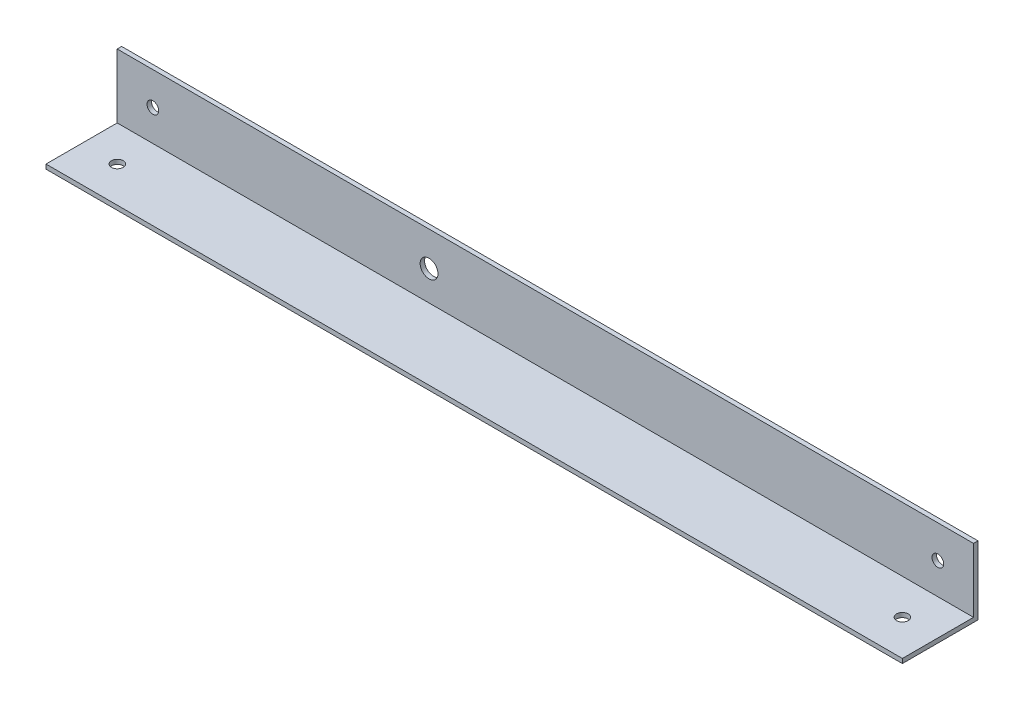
from build123d import *

# Parameters (mm, degrees)
SKETCH1_W           = 304.8
SKETCH1_H           = 24.384
BOSS_EXTRUDE1_DEPTH = 26.924
SKETCH2_W           = 304.8
SKETCH2_H           = 25.3365
CUT_EXTRUDE1_DEPTH  = 12.7
SKETCH3_W           = 304.8
SKETCH3_H           = 10.0965
CUT_EXTRUDE3_DEPTH  = 25.3365
SKETCH4_R           = 2.0828
CUT_EXTRUDE4_DEPTH  = 2.54
SKETCH5_R           = 2.0828
CUT_EXTRUDE5_DEPTH  = 2.54
SKETCH6_R           = 3.18
CUT_EXTRUDE6_DEPTH  = 2.54


with BuildPart() as part:
    # Sketch1 → Boss-Extrude1 (new body)
    with BuildSketch(Plane.XY):
        with Locations((-57.426086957, 55.646509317)):
            Rectangle(SKETCH1_W, SKETCH1_H)
    extrude(amount=BOSS_EXTRUDE1_DEPTH)

    # Sketch2 → Cut-Extrude1 (cut)
    with BuildSketch(Plane(origin=(0, 67.838509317, 0), x_dir=(1, 0, 0), z_dir=(0, 1, 0))):
        with Locations((-57.426086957, -14.25575)):
            Rectangle(SKETCH2_W, SKETCH2_H)
    extrude(amount=-CUT_EXTRUDE1_DEPTH, mode=Mode.SUBTRACT)

    # Sketch3 → Cut-Extrude3 (cut)
    with BuildSketch(Plane.XY.offset(26.924)):
        with Locations((-57.426086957, 50.090259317)):
            Rectangle(SKETCH3_W, SKETCH3_H)
    extrude(amount=-CUT_EXTRUDE3_DEPTH, mode=Mode.SUBTRACT)

    # Sketch4 → Cut-Extrude4 (cut)
    with BuildSketch(Plane(origin=(0, 0, 0), x_dir=(-1, 0, 0), z_dir=(0, 0, -1))):
        with Locations((-82.273913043, 56.154509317)):
            Circle(SKETCH4_R)
        with Locations((197.126086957, 56.154509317)):
            Circle(SKETCH4_R)
    extrude(amount=-CUT_EXTRUDE4_DEPTH, mode=Mode.SUBTRACT)

    # Sketch5 → Cut-Extrude5 (cut)
    with BuildSketch(Plane.XZ.offset(-43.454509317)):
        with Locations(Location((-197.126086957, 14.224, 0), (0, 0, 270))):
            Circle(SKETCH5_R)
        with Locations(Location((82.273913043, 14.224, 0), (0, 0, 270))):
            Circle(SKETCH5_R)
    extrude(amount=-CUT_EXTRUDE5_DEPTH, mode=Mode.SUBTRACT)

    # Sketch6 → Cut-Extrude6 (cut)
    with BuildSketch(Plane(origin=(0, 0, 0), x_dir=(-1, 0, 0), z_dir=(0, 0, -1))):
        with Locations((98.828086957, 55.646509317)):
            Circle(SKETCH6_R)
    extrude(amount=-CUT_EXTRUDE6_DEPTH, mode=Mode.SUBTRACT)


solid = part.part
